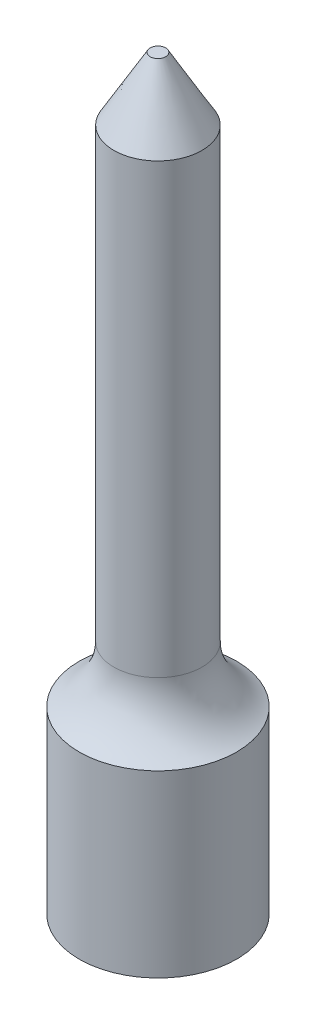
ISO-10303-21;
HEADER;
FILE_DESCRIPTION(('STEP AP214'),'2;1');
FILE_NAME('part.step','',(''),(''),'','','');
FILE_SCHEMA(('AUTOMOTIVE_DESIGN { 1 0 10303 214 1 1 1 1 }'));
ENDSEC;
DATA;
#1=APPLICATION_CONTEXT('core data for automotive mechanical design processes');
#2=APPLICATION_PROTOCOL_DEFINITION('international standard','automotive_design',2000,#1);
#3=PRODUCT_CONTEXT('',#1,'mechanical');
#4=PRODUCT('Part','Part','',(#3));
#5=PRODUCT_RELATED_PRODUCT_CATEGORY('part','',(#4));
#6=PRODUCT_DEFINITION_FORMATION('','',#4);
#7=PRODUCT_DEFINITION_CONTEXT('part definition',#1,'design');
#8=PRODUCT_DEFINITION('design','',#6,#7);
#9=PRODUCT_DEFINITION_SHAPE('','',#8);
#10=(LENGTH_UNIT() NAMED_UNIT(*) SI_UNIT(.MILLI.,.METRE.));
#11=(NAMED_UNIT(*) PLANE_ANGLE_UNIT() SI_UNIT($,.RADIAN.));
#12=(NAMED_UNIT(*) SI_UNIT($,.STERADIAN.) SOLID_ANGLE_UNIT());
#13=UNCERTAINTY_MEASURE_WITH_UNIT(LENGTH_MEASURE(1.E-05),#10,'distance_accuracy_value','');
#14=(GEOMETRIC_REPRESENTATION_CONTEXT(3) GLOBAL_UNCERTAINTY_ASSIGNED_CONTEXT((#13)) GLOBAL_UNIT_ASSIGNED_CONTEXT((#10,
#11,#12)) REPRESENTATION_CONTEXT('',''));
#15=CARTESIAN_POINT('',(0.,0.,0.));
#16=DIRECTION('',(0.,0.,1.));
#17=DIRECTION('',(1.,0.,0.));
#18=AXIS2_PLACEMENT_3D('',#15,#16,#17);
#19=CARTESIAN_POINT('',(0.,3.74302855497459,0.));
#20=DIRECTION('',(0.,-1.,0.));
#21=DIRECTION('',(0.,0.,-1.));
#22=AXIS2_PLACEMENT_3D('',#19,#20,#21);
#23=TOROIDAL_SURFACE('',#22,1.7,1.);
#24=CARTESIAN_POINT('',(0.,3.74302855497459,0.));
#25=DIRECTION('',(0.,1.,0.));
#26=DIRECTION('',(0.,0.,-1.));
#27=AXIS2_PLACEMENT_3D('',#24,#25,#26);
#28=CIRCLE('',#27,0.7);
#29=CARTESIAN_POINT('',(0.,3.74302855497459,-0.7));
#30=VERTEX_POINT('',#29);
#31=EDGE_CURVE('E29',#30,#30,#28,.T.);
#32=ORIENTED_EDGE('',*,*,#31,.F.);
#33=EDGE_LOOP('',(#32));
#34=FACE_BOUND('',#33,.T.);
#35=CARTESIAN_POINT('',(0.,2.85,0.));
#36=DIRECTION('',(0.,1.,0.));
#37=DIRECTION('',(0.,0.,1.));
#38=AXIS2_PLACEMENT_3D('',#35,#36,#37);
#39=CIRCLE('',#38,1.25);
#40=CARTESIAN_POINT('',(0.,2.85,1.25));
#41=VERTEX_POINT('',#40);
#42=EDGE_CURVE('E10',#41,#41,#39,.T.);
#43=ORIENTED_EDGE('',*,*,#42,.T.);
#44=EDGE_LOOP('',(#43));
#45=FACE_BOUND('',#44,.T.);
#46=ADVANCED_FACE('F15',(#34,#45),#23,.F.);
#47=CARTESIAN_POINT('',(0.,11.85,0.));
#48=DIRECTION('',(0.,-1.,0.));
#49=DIRECTION('',(0.,0.,-1.));
#50=AXIS2_PLACEMENT_3D('',#47,#48,#49);
#51=CONICAL_SURFACE('',#50,0.122649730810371,0.523598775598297);
#52=CARTESIAN_POINT('',(0.,10.85,0.));
#53=DIRECTION('',(0.,-1.,0.));
#54=DIRECTION('',(0.,0.,1.));
#55=AXIS2_PLACEMENT_3D('',#52,#53,#54);
#56=CIRCLE('',#55,0.7);
#57=CARTESIAN_POINT('',(0.,10.85,-0.699999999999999));
#58=VERTEX_POINT('',#57);
#59=EDGE_CURVE('E23',#58,#58,#56,.T.);
#60=CARTESIAN_POINT('',(0.,11.85,0.));
#61=DIRECTION('',(0.,1.,0.));
#62=DIRECTION('',(0.,0.,1.));
#63=AXIS2_PLACEMENT_3D('',#60,#61,#62);
#64=CIRCLE('',#63,0.122649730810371);
#65=CARTESIAN_POINT('',(0.,11.85,-0.122649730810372));
#66=VERTEX_POINT('',#65);
#67=EDGE_CURVE('E32',#66,#66,#64,.T.);
#68=CARTESIAN_POINT('',(0.,10.85,-0.699999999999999));
#69=CARTESIAN_POINT('',(0.,10.8604166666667,-0.693985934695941));
#70=CARTESIAN_POINT('',(0.,10.8708333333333,-0.687971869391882));
#71=CARTESIAN_POINT('',(0.,10.8916666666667,-0.675943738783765));
#72=CARTESIAN_POINT('',(0.,10.9020833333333,-0.669929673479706));
#73=CARTESIAN_POINT('',(0.,10.9229166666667,-0.657901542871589));
#74=CARTESIAN_POINT('',(0.,10.9333333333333,-0.651887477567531));
#75=CARTESIAN_POINT('',(0.,10.9541666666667,-0.639859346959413));
#76=CARTESIAN_POINT('',(0.,10.9645833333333,-0.633845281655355));
#77=CARTESIAN_POINT('',(0.,10.9854166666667,-0.621817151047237));
#78=CARTESIAN_POINT('',(0.,10.9958333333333,-0.615803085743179));
#79=CARTESIAN_POINT('',(0.,11.0166666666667,-0.603774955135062));
#80=CARTESIAN_POINT('',(0.,11.0270833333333,-0.597760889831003));
#81=CARTESIAN_POINT('',(0.,11.0479166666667,-0.585732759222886));
#82=CARTESIAN_POINT('',(0.,11.0583333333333,-0.579718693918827));
#83=CARTESIAN_POINT('',(0.,11.0791666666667,-0.56769056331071));
#84=CARTESIAN_POINT('',(0.,11.0895833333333,-0.561676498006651));
#85=CARTESIAN_POINT('',(0.,11.1104166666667,-0.549648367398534));
#86=CARTESIAN_POINT('',(0.,11.1208333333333,-0.543634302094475));
#87=CARTESIAN_POINT('',(0.,11.1416666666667,-0.531606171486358));
#88=CARTESIAN_POINT('',(0.,11.1520833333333,-0.525592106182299));
#89=CARTESIAN_POINT('',(0.,11.1729166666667,-0.513563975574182));
#90=CARTESIAN_POINT('',(0.,11.1833333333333,-0.507549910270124));
#91=CARTESIAN_POINT('',(0.,11.2041666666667,-0.495521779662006));
#92=CARTESIAN_POINT('',(0.,11.2145833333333,-0.489507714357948));
#93=CARTESIAN_POINT('',(0.,11.2354166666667,-0.47747958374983));
#94=CARTESIAN_POINT('',(0.,11.2458333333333,-0.471465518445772));
#95=CARTESIAN_POINT('',(0.,11.2666666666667,-0.459437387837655));
#96=CARTESIAN_POINT('',(0.,11.2770833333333,-0.453423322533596));
#97=CARTESIAN_POINT('',(0.,11.2979166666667,-0.441395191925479));
#98=CARTESIAN_POINT('',(0.,11.3083333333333,-0.43538112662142));
#99=CARTESIAN_POINT('',(0.,11.3291666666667,-0.423352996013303));
#100=CARTESIAN_POINT('',(0.,11.3395833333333,-0.417338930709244));
#101=CARTESIAN_POINT('',(0.,11.3604166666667,-0.405310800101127));
#102=CARTESIAN_POINT('',(0.,11.3708333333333,-0.399296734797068));
#103=CARTESIAN_POINT('',(0.,11.3916666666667,-0.387268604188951));
#104=CARTESIAN_POINT('',(0.,11.4020833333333,-0.381254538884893));
#105=CARTESIAN_POINT('',(0.,11.4229166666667,-0.369226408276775));
#106=CARTESIAN_POINT('',(0.,11.4333333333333,-0.363212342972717));
#107=CARTESIAN_POINT('',(0.,11.4541666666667,-0.351184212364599));
#108=CARTESIAN_POINT('',(0.,11.4645833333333,-0.345170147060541));
#109=CARTESIAN_POINT('',(0.,11.4854166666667,-0.333142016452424));
#110=CARTESIAN_POINT('',(0.,11.4958333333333,-0.327127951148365));
#111=CARTESIAN_POINT('',(0.,11.5166666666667,-0.315099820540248));
#112=CARTESIAN_POINT('',(0.,11.5270833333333,-0.309085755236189));
#113=CARTESIAN_POINT('',(0.,11.5479166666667,-0.297057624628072));
#114=CARTESIAN_POINT('',(0.,11.5583333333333,-0.291043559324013));
#115=CARTESIAN_POINT('',(0.,11.5791666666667,-0.279015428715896));
#116=CARTESIAN_POINT('',(0.,11.5895833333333,-0.273001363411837));
#117=CARTESIAN_POINT('',(0.,11.6104166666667,-0.26097323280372));
#118=CARTESIAN_POINT('',(0.,11.6208333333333,-0.254959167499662));
#119=CARTESIAN_POINT('',(0.,11.6416666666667,-0.242931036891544));
#120=CARTESIAN_POINT('',(0.,11.6520833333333,-0.236916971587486));
#121=CARTESIAN_POINT('',(0.,11.6729166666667,-0.224888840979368));
#122=CARTESIAN_POINT('',(0.,11.6833333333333,-0.21887477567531));
#123=CARTESIAN_POINT('',(0.,11.7041666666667,-0.206846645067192));
#124=CARTESIAN_POINT('',(0.,11.7145833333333,-0.200832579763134));
#125=CARTESIAN_POINT('',(0.,11.7354166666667,-0.188804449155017));
#126=CARTESIAN_POINT('',(0.,11.7458333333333,-0.182790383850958));
#127=CARTESIAN_POINT('',(0.,11.7666666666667,-0.170762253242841));
#128=CARTESIAN_POINT('',(0.,11.7770833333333,-0.164748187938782));
#129=CARTESIAN_POINT('',(0.,11.7979166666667,-0.152720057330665));
#130=CARTESIAN_POINT('',(0.,11.8083333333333,-0.146705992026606));
#131=CARTESIAN_POINT('',(0.,11.8291666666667,-0.134677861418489));
#132=CARTESIAN_POINT('',(0.,11.8395833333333,-0.12866379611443));
#133=CARTESIAN_POINT('',(0.,11.85,-0.122649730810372));
#134=B_SPLINE_CURVE_WITH_KNOTS('',3,(#68,#69,#70,#71,#72,#73,#74,#75,#76,#77,#78,#79,#80,#81,
#82,#83,#84,#85,#86,#87,#88,#89,#90,#91,#92,#93,#94,#95,#96,#97,#98,#99,#100,#101,#102,#103,
#104,#105,#106,#107,#108,#109,#110,#111,#112,#113,#114,#115,#116,#117,#118,#119,#120,#121,#122,
#123,#124,#125,#126,#127,#128,#129,#130,#131,#132,#133),.UNSPECIFIED.,.F.,.F.,(4,2,2,2,2,2,2,2,
2,2,2,2,2,2,2,2,2,2,2,2,2,2,2,2,2,2,2,2,2,2,2,2,4),(0.,0.0360843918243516,0.0721687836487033,
0.108253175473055,0.144337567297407,0.180421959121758,0.21650635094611,0.252590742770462,
0.288675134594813,0.324759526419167,0.360843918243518,0.39692831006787,0.433012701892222,
0.469097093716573,0.505181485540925,0.541265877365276,0.57735026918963,0.613434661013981,
0.649519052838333,0.685603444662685,0.721687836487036,0.757772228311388,0.79385662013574,
0.829941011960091,0.866025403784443,0.902109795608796,0.938194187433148,0.974278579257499,
1.01036297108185,1.0464473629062,1.08253175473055,1.11861614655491,1.15470053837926),.UNSPECIFIED.);
#135=EDGE_CURVE('BSEAM37',#58,#66,#134,.T.);
#136=ORIENTED_EDGE('',*,*,#59,.F.);
#137=ORIENTED_EDGE('',*,*,#67,.F.);
#138=ORIENTED_EDGE('',*,*,#135,.T.);
#139=ORIENTED_EDGE('',*,*,#135,.F.);
#140=EDGE_LOOP('',(#136,#138,#137,#139));
#141=FACE_BOUND('',#140,.T.);
#142=ADVANCED_FACE('F37',(#141),#51,.T.);
#143=CARTESIAN_POINT('',(0.,11.85,0.));
#144=DIRECTION('',(0.,-1.,0.));
#145=DIRECTION('',(0.,0.,-1.));
#146=AXIS2_PLACEMENT_3D('',#143,#144,#145);
#147=CYLINDRICAL_SURFACE('',#146,0.7);
#148=ORIENTED_EDGE('',*,*,#31,.T.);
#149=EDGE_LOOP('',(#148));
#150=FACE_BOUND('',#149,.T.);
#151=ORIENTED_EDGE('',*,*,#59,.T.);
#152=EDGE_LOOP('',(#151));
#153=FACE_BOUND('',#152,.T.);
#154=ADVANCED_FACE('F39',(#150,#153),#147,.T.);
#155=CARTESIAN_POINT('',(0.,2.85,0.));
#156=DIRECTION('',(0.,-1.,0.));
#157=DIRECTION('',(0.,0.,-1.));
#158=AXIS2_PLACEMENT_3D('',#155,#156,#157);
#159=CYLINDRICAL_SURFACE('',#158,1.25);
#160=CARTESIAN_POINT('',(0.,0.,0.));
#161=DIRECTION('',(0.,1.,0.));
#162=DIRECTION('',(0.,0.,1.));
#163=AXIS2_PLACEMENT_3D('',#160,#161,#162);
#164=CIRCLE('',#163,1.25);
#165=CARTESIAN_POINT('',(0.,0.,1.25));
#166=VERTEX_POINT('',#165);
#167=EDGE_CURVE('E19',#166,#166,#164,.T.);
#168=ORIENTED_EDGE('',*,*,#167,.T.);
#169=EDGE_LOOP('',(#168));
#170=FACE_BOUND('',#169,.T.);
#171=ORIENTED_EDGE('',*,*,#42,.F.);
#172=EDGE_LOOP('',(#171));
#173=FACE_BOUND('',#172,.T.);
#174=ADVANCED_FACE('F47',(#170,#173),#159,.T.);
#175=CARTESIAN_POINT('',(0.,0.,0.));
#176=DIRECTION('',(0.,1.,0.));
#177=DIRECTION('',(0.,0.,1.));
#178=AXIS2_PLACEMENT_3D('',#175,#176,#177);
#179=PLANE('',#178);
#180=ORIENTED_EDGE('',*,*,#167,.F.);
#181=EDGE_LOOP('',(#180));
#182=FACE_BOUND('',#181,.T.);
#183=ADVANCED_FACE('F55',(#182),#179,.F.);
#184=CARTESIAN_POINT('',(0.,11.85,0.));
#185=DIRECTION('',(0.,1.,0.));
#186=DIRECTION('',(0.,0.,1.));
#187=AXIS2_PLACEMENT_3D('',#184,#185,#186);
#188=PLANE('',#187);
#189=ORIENTED_EDGE('',*,*,#67,.T.);
#190=EDGE_LOOP('',(#189));
#191=FACE_BOUND('',#190,.T.);
#192=ADVANCED_FACE('F17',(#191),#188,.T.);
#193=CLOSED_SHELL('',(#46,#142,#154,#174,#183,#192));
#194=MANIFOLD_SOLID_BREP('B1',#193);
#195=ADVANCED_BREP_SHAPE_REPRESENTATION('',(#18,#194),#14);
#196=SHAPE_DEFINITION_REPRESENTATION(#9,#195);
ENDSEC;
END-ISO-10303-21;
